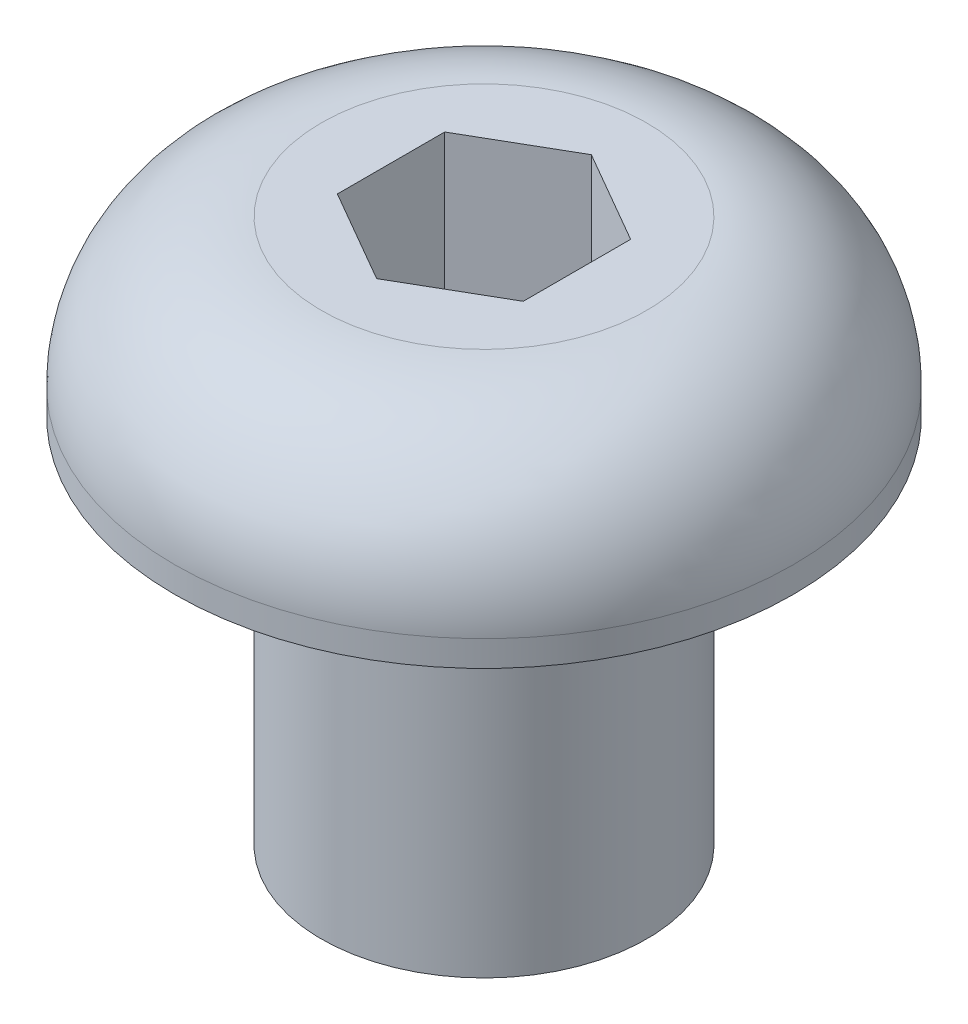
from build123d import *

# Parameters (mm, degrees)
CUT_EXTRUDE1_DEPTH = 2.54


with BuildPart() as part:
    # Sketch1 → Revolve1 (revolve)
    with BuildSketch(Plane.XY, mode=Mode.PRIVATE) as revolve1_sk:
        with BuildLine():
            Line((0, -6.9723), (2.0828, -6.9723))
            Line((2.0828, -6.9723), (2.0828, -2.2098))
            Line((2.0828, -2.2098), (3.9624, -2.2098))
            Line((3.9624, -2.2098), (3.9624, -1.8796))
            ThreePointArc((3.9624, -1.8796), (3.411877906, -0.550522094), (2.0828, 0))
            Line((2.0828, 0), (0, 0))
            Line((0, 0), (0, -6.9723))
        make_face()
    revolve(revolve1_sk.sketch.rotate(Axis((0, 0, 0), (0, -1, 0)), 180), axis=Axis((0, 0, 0), (0, -1, 0)))

    # Sketch2 → Cut-Extrude1 (cut)
    with BuildSketch(Plane(origin=(0, 0, 0), x_dir=(1, 0, 0), z_dir=(0, 1, 0))):
        Polygon((0, 1.374815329), (-1.190625, 0.687407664), (-1.190625, -0.687407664), (0, -1.374815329), (1.190625, -0.687407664), (1.190625, 0.687407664), align=None)
    extrude(amount=-CUT_EXTRUDE1_DEPTH, mode=Mode.SUBTRACT)


solid = part.part
